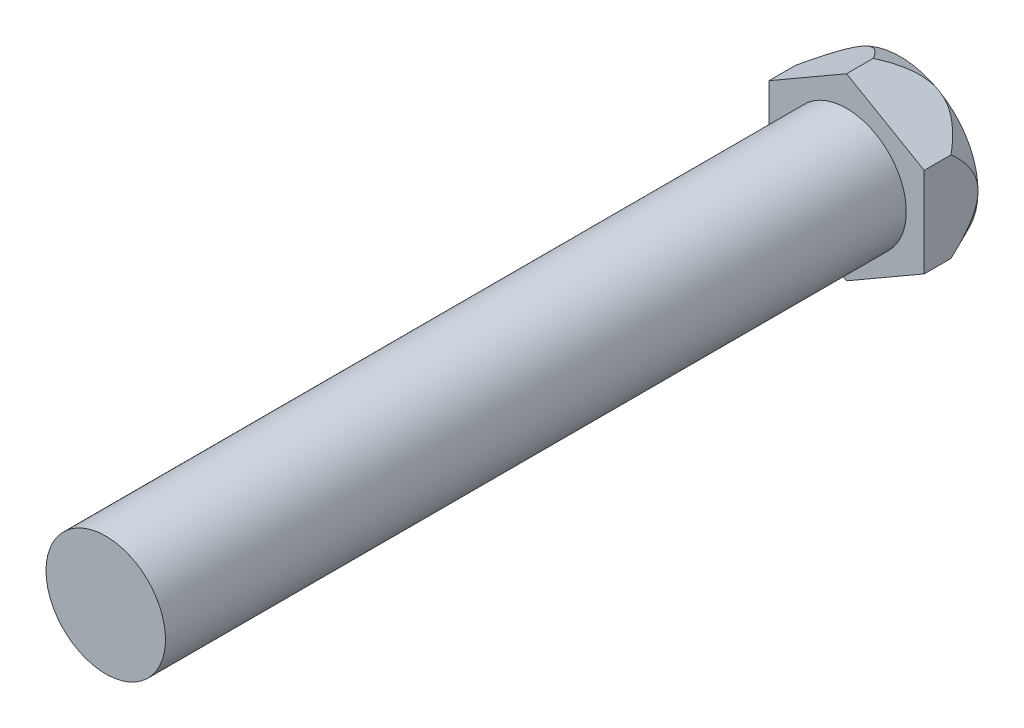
from build123d import *

# Parameters (mm, degrees)
BOSS_EXTRUDE1_DEPTH = 1.8
SKETCH2_OUTSIDE_W   = 13.602
SKETCH2_OUTSIDE_H   = 14.406
SKETCH2_OUTSIDE_R   = 2.6
CUT_EXTRUDE1_DEPTH  = 5.360428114
CUT_EXTRUDE1_DRAFT  = -24
SKETCH3_R           = 2
BOSS_EXTRUDE2_DEPTH = 24.8


with BuildPart() as part:
    # Sketch1 → Boss-Extrude1 (new body)
    with BuildSketch(Plane.XY):
        Polygon((0, 3.0022214), (-2.6, 1.5011107), (-2.6, -1.5011107), (0, -3.0022214), (2.6, -1.5011107), (2.6, 1.5011107), align=None)
    extrude(amount=BOSS_EXTRUDE1_DEPTH)


with BuildPart() as cut_extrude1_tool:
    # Sketch2 outside → Cut-Extrude1 (with draft: the straight prism first)
    with BuildSketch(Plane(origin=(0, 0, 0), x_dir=(-1, 0, 0), z_dir=(0, 0, -1))):
        Rectangle(SKETCH2_OUTSIDE_W, SKETCH2_OUTSIDE_H)
        Circle(SKETCH2_OUTSIDE_R, mode=Mode.SUBTRACT)
    extrude(amount=-CUT_EXTRUDE1_DEPTH)
    # Cut-Extrude1: the draft: its side faces are tilted about the plane it starts from
    cut_extrude1_sides = [cut_extrude1_tool.faces().sort_by_distance(p)[0] for p in [
        (0, -7.203, 2.680214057),
        (-6.801, 0, 2.680214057),
        (0, 7.203, 2.680214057),
        (6.801, 0, 2.680214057),
        (2.6, 0, 2.680214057),
    ]]
    draft(cut_extrude1_sides, Plane(origin=(0, 0, 0), x_dir=(-1, 0, 0), z_dir=(0, 0, -1)), CUT_EXTRUDE1_DRAFT)


with BuildPart() as part_1:
    add(part.part)

    # Cut-Extrude1: cut by cut_extrude1_tool
    add(cut_extrude1_tool.part, mode=Mode.SUBTRACT)

    # Sketch3 → Boss-Extrude2 (add)
    with BuildSketch(Plane.XY.offset(1.8)):
        with Locations(Location((0, 0, 0), (0, 0, 180))):
            Circle(SKETCH3_R)
    extrude(amount=BOSS_EXTRUDE2_DEPTH)


solid = part_1.part
